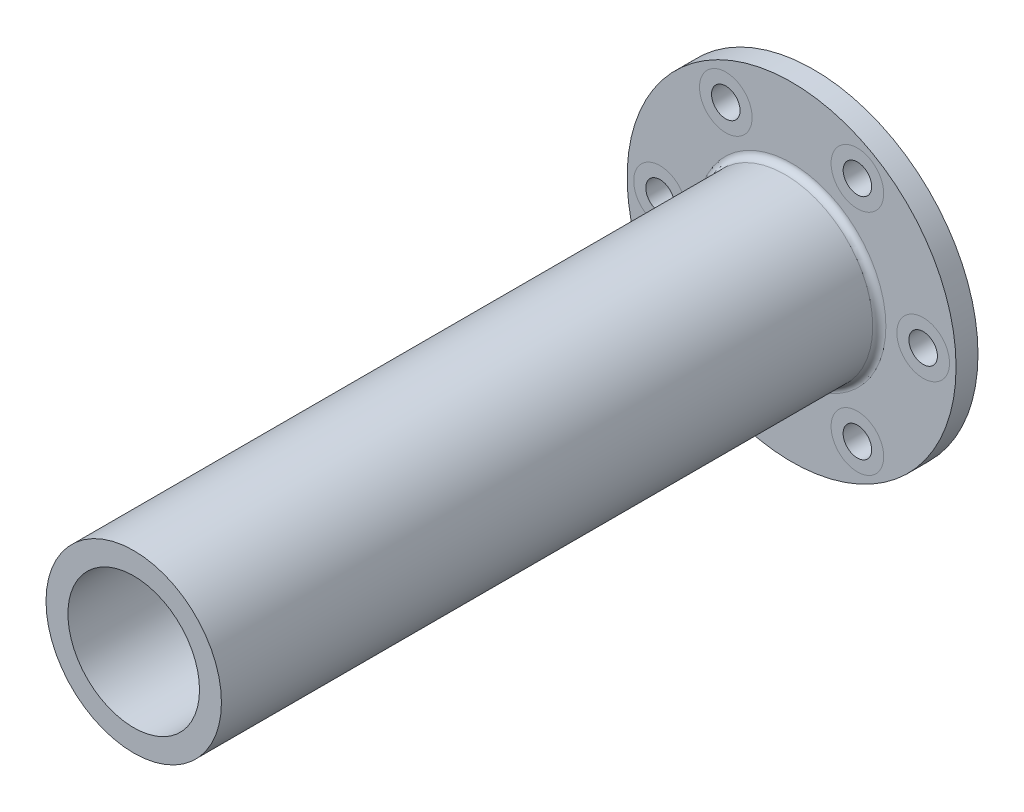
ISO-10303-21;
HEADER;
FILE_DESCRIPTION(('STEP AP214'),'2;1');
FILE_NAME('part.step','',(''),(''),'','','');
FILE_SCHEMA(('AUTOMOTIVE_DESIGN { 1 0 10303 214 1 1 1 1 }'));
ENDSEC;
DATA;
#1=APPLICATION_CONTEXT('core data for automotive mechanical design processes');
#2=APPLICATION_PROTOCOL_DEFINITION('international standard','automotive_design',2000,#1);
#3=PRODUCT_CONTEXT('',#1,'mechanical');
#4=PRODUCT('Part','Part','',(#3));
#5=PRODUCT_RELATED_PRODUCT_CATEGORY('part','',(#4));
#6=PRODUCT_DEFINITION_FORMATION('','',#4);
#7=PRODUCT_DEFINITION_CONTEXT('part definition',#1,'design');
#8=PRODUCT_DEFINITION('design','',#6,#7);
#9=PRODUCT_DEFINITION_SHAPE('','',#8);
#10=(LENGTH_UNIT() NAMED_UNIT(*) SI_UNIT(.MILLI.,.METRE.));
#11=(NAMED_UNIT(*) PLANE_ANGLE_UNIT() SI_UNIT($,.RADIAN.));
#12=(NAMED_UNIT(*) SI_UNIT($,.STERADIAN.) SOLID_ANGLE_UNIT());
#13=UNCERTAINTY_MEASURE_WITH_UNIT(LENGTH_MEASURE(1.E-05),#10,'distance_accuracy_value','');
#14=(GEOMETRIC_REPRESENTATION_CONTEXT(3) GLOBAL_UNCERTAINTY_ASSIGNED_CONTEXT((#13)) GLOBAL_UNIT_ASSIGNED_CONTEXT((#10,
#11,#12)) REPRESENTATION_CONTEXT('',''));
#15=CARTESIAN_POINT('',(0.,0.,0.));
#16=DIRECTION('',(0.,0.,1.));
#17=DIRECTION('',(1.,0.,0.));
#18=AXIS2_PLACEMENT_3D('',#15,#16,#17);
#19=CARTESIAN_POINT('',(0.,0.,10.));
#20=DIRECTION('',(0.,0.,1.));
#21=DIRECTION('',(1.,0.,0.));
#22=AXIS2_PLACEMENT_3D('',#19,#20,#21);
#23=PLANE('',#22);
#24=CARTESIAN_POINT('',(-29.9999999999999,51.9615242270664,10.));
#25=DIRECTION('',(0.,0.,1.));
#26=DIRECTION('',(1.,0.,0.));
#27=AXIS2_PLACEMENT_3D('',#24,#25,#26);
#28=CIRCLE('',#27,12.);
#29=CARTESIAN_POINT('',(-17.9999999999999,51.9615242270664,10.));
#30=VERTEX_POINT('',#29);
#31=EDGE_CURVE('E39',#30,#30,#28,.F.);
#32=ORIENTED_EDGE('',*,*,#31,.T.);
#33=EDGE_LOOP('',(#32));
#34=FACE_BOUND('',#33,.T.);
#35=CARTESIAN_POINT('',(60.,-4.18935719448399E-13,10.));
#36=DIRECTION('',(0.,0.,1.));
#37=DIRECTION('',(1.,0.,0.));
#38=AXIS2_PLACEMENT_3D('',#35,#36,#37);
#39=CIRCLE('',#38,12.);
#40=CARTESIAN_POINT('',(72.,-4.18935719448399E-13,10.));
#41=VERTEX_POINT('',#40);
#42=EDGE_CURVE('E53',#41,#41,#39,.F.);
#43=ORIENTED_EDGE('',*,*,#42,.T.);
#44=EDGE_LOOP('',(#43));
#45=FACE_BOUND('',#44,.T.);
#46=CARTESIAN_POINT('',(-30.0000000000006,-51.961524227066,10.));
#47=DIRECTION('',(0.,0.,1.));
#48=DIRECTION('',(1.,0.,0.));
#49=AXIS2_PLACEMENT_3D('',#46,#47,#48);
#50=CIRCLE('',#49,12.);
#51=CARTESIAN_POINT('',(-18.0000000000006,-51.961524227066,10.));
#52=VERTEX_POINT('',#51);
#53=EDGE_CURVE('E63',#52,#52,#50,.F.);
#54=ORIENTED_EDGE('',*,*,#53,.T.);
#55=EDGE_LOOP('',(#54));
#56=FACE_BOUND('',#55,.T.);
#57=CARTESIAN_POINT('',(0.,0.,10.));
#58=DIRECTION('',(0.,0.,1.));
#59=DIRECTION('',(1.,0.,0.));
#60=AXIS2_PLACEMENT_3D('',#57,#58,#59);
#61=CIRCLE('',#60,43.);
#62=CARTESIAN_POINT('',(43.,0.,10.));
#63=VERTEX_POINT('',#62);
#64=EDGE_CURVE('E67',#63,#63,#61,.F.);
#65=ORIENTED_EDGE('',*,*,#64,.T.);
#66=EDGE_LOOP('',(#65));
#67=FACE_BOUND('',#66,.T.);
#68=CARTESIAN_POINT('',(0.,0.,10.));
#69=DIRECTION('',(0.,0.,1.));
#70=DIRECTION('',(1.,0.,0.));
#71=AXIS2_PLACEMENT_3D('',#68,#69,#70);
#72=CIRCLE('',#71,75.);
#73=CARTESIAN_POINT('',(75.,0.,10.));
#74=VERTEX_POINT('',#73);
#75=EDGE_CURVE('E73',#74,#74,#72,.T.);
#76=ORIENTED_EDGE('',*,*,#75,.T.);
#77=EDGE_LOOP('',(#76));
#78=FACE_BOUND('',#77,.T.);
#79=CARTESIAN_POINT('',(29.9999999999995,-51.9615242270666,10.));
#80=DIRECTION('',(0.,0.,1.));
#81=DIRECTION('',(1.,0.,0.));
#82=AXIS2_PLACEMENT_3D('',#79,#80,#81);
#83=CIRCLE('',#82,12.);
#84=CARTESIAN_POINT('',(41.9999999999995,-51.9615242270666,10.));
#85=VERTEX_POINT('',#84);
#86=EDGE_CURVE('E59',#85,#85,#83,.F.);
#87=ORIENTED_EDGE('',*,*,#86,.T.);
#88=EDGE_LOOP('',(#87));
#89=FACE_BOUND('',#88,.T.);
#90=CARTESIAN_POINT('',(30.0000000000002,51.9615242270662,10.));
#91=DIRECTION('',(0.,0.,1.));
#92=DIRECTION('',(1.,0.,0.));
#93=AXIS2_PLACEMENT_3D('',#90,#91,#92);
#94=CIRCLE('',#93,12.);
#95=CARTESIAN_POINT('',(42.0000000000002,51.9615242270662,10.));
#96=VERTEX_POINT('',#95);
#97=EDGE_CURVE('E46',#96,#96,#94,.F.);
#98=ORIENTED_EDGE('',*,*,#97,.T.);
#99=EDGE_LOOP('',(#98));
#100=FACE_BOUND('',#99,.T.);
#101=CARTESIAN_POINT('',(-60.,0.,10.));
#102=DIRECTION('',(0.,0.,1.));
#103=DIRECTION('',(1.,0.,0.));
#104=AXIS2_PLACEMENT_3D('',#101,#102,#103);
#105=CIRCLE('',#104,12.);
#106=CARTESIAN_POINT('',(-48.,0.,10.));
#107=VERTEX_POINT('',#106);
#108=EDGE_CURVE('E10',#107,#107,#105,.F.);
#109=ORIENTED_EDGE('',*,*,#108,.T.);
#110=EDGE_LOOP('',(#109));
#111=FACE_BOUND('',#110,.T.);
#112=ADVANCED_FACE('F31',(#34,#45,#56,#67,#78,#89,#100,#111),#23,.T.);
#113=ORIENTED_EDGE('',*,*,#108,.F.);
#114=EDGE_LOOP('',(#113));
#115=FACE_BOUND('',#114,.T.);
#116=CARTESIAN_POINT('',(-60.,0.,10.));
#117=DIRECTION('',(0.,0.,1.));
#118=DIRECTION('',(1.,0.,0.));
#119=AXIS2_PLACEMENT_3D('',#116,#117,#118);
#120=CIRCLE('',#119,6.5);
#121=CARTESIAN_POINT('',(-53.5,0.,10.));
#122=VERTEX_POINT('',#121);
#123=EDGE_CURVE('E88',#122,#122,#120,.T.);
#124=ORIENTED_EDGE('',*,*,#123,.F.);
#125=EDGE_LOOP('',(#124));
#126=FACE_BOUND('',#125,.T.);
#127=ADVANCED_FACE('F157',(#115,#126),#23,.T.);
#128=ORIENTED_EDGE('',*,*,#31,.F.);
#129=EDGE_LOOP('',(#128));
#130=FACE_BOUND('',#129,.T.);
#131=CARTESIAN_POINT('',(-29.9999999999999,51.9615242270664,10.));
#132=DIRECTION('',(0.,0.,1.));
#133=DIRECTION('',(1.,0.,0.));
#134=AXIS2_PLACEMENT_3D('',#131,#132,#133);
#135=CIRCLE('',#134,6.5);
#136=CARTESIAN_POINT('',(-23.4999999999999,51.9615242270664,10.));
#137=VERTEX_POINT('',#136);
#138=EDGE_CURVE('E94',#137,#137,#135,.T.);
#139=ORIENTED_EDGE('',*,*,#138,.F.);
#140=EDGE_LOOP('',(#139));
#141=FACE_BOUND('',#140,.T.);
#142=ADVANCED_FACE('F162',(#130,#141),#23,.T.);
#143=ORIENTED_EDGE('',*,*,#97,.F.);
#144=EDGE_LOOP('',(#143));
#145=FACE_BOUND('',#144,.T.);
#146=CARTESIAN_POINT('',(30.0000000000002,51.9615242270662,10.));
#147=DIRECTION('',(0.,0.,1.));
#148=DIRECTION('',(1.,0.,0.));
#149=AXIS2_PLACEMENT_3D('',#146,#147,#148);
#150=CIRCLE('',#149,6.5);
#151=CARTESIAN_POINT('',(36.5000000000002,51.9615242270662,10.));
#152=VERTEX_POINT('',#151);
#153=EDGE_CURVE('E100',#152,#152,#150,.T.);
#154=ORIENTED_EDGE('',*,*,#153,.F.);
#155=EDGE_LOOP('',(#154));
#156=FACE_BOUND('',#155,.T.);
#157=ADVANCED_FACE('F228',(#145,#156),#23,.T.);
#158=ORIENTED_EDGE('',*,*,#42,.F.);
#159=EDGE_LOOP('',(#158));
#160=FACE_BOUND('',#159,.T.);
#161=CARTESIAN_POINT('',(60.,-4.18978003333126E-13,10.));
#162=DIRECTION('',(0.,0.,1.));
#163=DIRECTION('',(1.,0.,0.));
#164=AXIS2_PLACEMENT_3D('',#161,#162,#163);
#165=CIRCLE('',#164,6.5);
#166=CARTESIAN_POINT('',(66.5,-4.18978003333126E-13,10.));
#167=VERTEX_POINT('',#166);
#168=EDGE_CURVE('E106',#167,#167,#165,.T.);
#169=ORIENTED_EDGE('',*,*,#168,.F.);
#170=EDGE_LOOP('',(#169));
#171=FACE_BOUND('',#170,.T.);
#172=ADVANCED_FACE('F220',(#160,#171),#23,.T.);
#173=ORIENTED_EDGE('',*,*,#86,.F.);
#174=EDGE_LOOP('',(#173));
#175=FACE_BOUND('',#174,.T.);
#176=CARTESIAN_POINT('',(29.9999999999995,-51.9615242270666,10.));
#177=DIRECTION('',(0.,0.,1.));
#178=DIRECTION('',(1.,0.,0.));
#179=AXIS2_PLACEMENT_3D('',#176,#177,#178);
#180=CIRCLE('',#179,6.5);
#181=CARTESIAN_POINT('',(36.4999999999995,-51.9615242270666,10.));
#182=VERTEX_POINT('',#181);
#183=EDGE_CURVE('E112',#182,#182,#180,.T.);
#184=ORIENTED_EDGE('',*,*,#183,.F.);
#185=EDGE_LOOP('',(#184));
#186=FACE_BOUND('',#185,.T.);
#187=ADVANCED_FACE('F153',(#175,#186),#23,.T.);
#188=ORIENTED_EDGE('',*,*,#53,.F.);
#189=EDGE_LOOP('',(#188));
#190=FACE_BOUND('',#189,.T.);
#191=CARTESIAN_POINT('',(-30.0000000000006,-51.961524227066,10.));
#192=DIRECTION('',(0.,0.,1.));
#193=DIRECTION('',(1.,0.,0.));
#194=AXIS2_PLACEMENT_3D('',#191,#192,#193);
#195=CIRCLE('',#194,6.5);
#196=CARTESIAN_POINT('',(-23.5000000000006,-51.961524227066,10.));
#197=VERTEX_POINT('',#196);
#198=EDGE_CURVE('E118',#197,#197,#195,.T.);
#199=ORIENTED_EDGE('',*,*,#198,.F.);
#200=EDGE_LOOP('',(#199));
#201=FACE_BOUND('',#200,.T.);
#202=ADVANCED_FACE('F147',(#190,#201),#23,.T.);
#203=CARTESIAN_POINT('',(0.,0.,10.));
#204=DIRECTION('',(0.,0.,-1.));
#205=DIRECTION('',(-1.,0.,0.));
#206=AXIS2_PLACEMENT_3D('',#203,#204,#205);
#207=CYLINDRICAL_SURFACE('',#206,75.);
#208=ORIENTED_EDGE('',*,*,#75,.F.);
#209=EDGE_LOOP('',(#208));
#210=FACE_BOUND('',#209,.T.);
#211=CARTESIAN_POINT('',(0.,0.,0.));
#212=DIRECTION('',(0.,0.,1.));
#213=DIRECTION('',(1.,0.,0.));
#214=AXIS2_PLACEMENT_3D('',#211,#212,#213);
#215=CIRCLE('',#214,75.);
#216=CARTESIAN_POINT('',(75.,0.,0.));
#217=VERTEX_POINT('',#216);
#218=EDGE_CURVE('E76',#217,#217,#215,.T.);
#219=ORIENTED_EDGE('',*,*,#218,.T.);
#220=EDGE_LOOP('',(#219));
#221=FACE_BOUND('',#220,.T.);
#222=ADVANCED_FACE('F33',(#210,#221),#207,.T.);
#223=CARTESIAN_POINT('',(0.,0.,0.));
#224=DIRECTION('',(0.,0.,1.));
#225=DIRECTION('',(1.,0.,0.));
#226=AXIS2_PLACEMENT_3D('',#223,#224,#225);
#227=PLANE('',#226);
#228=CARTESIAN_POINT('',(-30.0000000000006,-51.961524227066,0.));
#229=DIRECTION('',(0.,0.,-1.));
#230=DIRECTION('',(-0.50000000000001,-0.866025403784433,0.));
#231=AXIS2_PLACEMENT_3D('',#228,#229,#230);
#232=CIRCLE('',#231,6.5);
#233=CARTESIAN_POINT('',(-33.2500000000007,-57.5906893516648,0.));
#234=VERTEX_POINT('',#233);
#235=EDGE_CURVE('E121',#234,#234,#232,.T.);
#236=ORIENTED_EDGE('',*,*,#235,.F.);
#237=EDGE_LOOP('',(#236));
#238=FACE_BOUND('',#237,.T.);
#239=CARTESIAN_POINT('',(29.9999999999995,-51.9615242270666,0.));
#240=DIRECTION('',(0.,0.,-1.));
#241=DIRECTION('',(0.499999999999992,-0.866025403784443,0.));
#242=AXIS2_PLACEMENT_3D('',#239,#240,#241);
#243=CIRCLE('',#242,6.5);
#244=CARTESIAN_POINT('',(33.2499999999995,-57.5906893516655,0.));
#245=VERTEX_POINT('',#244);
#246=EDGE_CURVE('E115',#245,#245,#243,.T.);
#247=ORIENTED_EDGE('',*,*,#246,.F.);
#248=EDGE_LOOP('',(#247));
#249=FACE_BOUND('',#248,.T.);
#250=CARTESIAN_POINT('',(60.,-4.18978003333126E-13,0.));
#251=DIRECTION('',(0.,0.,-1.));
#252=DIRECTION('',(1.,0.,0.));
#253=AXIS2_PLACEMENT_3D('',#250,#251,#252);
#254=CIRCLE('',#253,6.5);
#255=CARTESIAN_POINT('',(66.5,-4.64367287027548E-13,0.));
#256=VERTEX_POINT('',#255);
#257=EDGE_CURVE('E109',#256,#256,#254,.T.);
#258=ORIENTED_EDGE('',*,*,#257,.F.);
#259=EDGE_LOOP('',(#258));
#260=FACE_BOUND('',#259,.T.);
#261=CARTESIAN_POINT('',(30.0000000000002,51.9615242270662,0.));
#262=DIRECTION('',(0.,0.,-1.));
#263=DIRECTION('',(0.500000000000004,0.866025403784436,0.));
#264=AXIS2_PLACEMENT_3D('',#261,#262,#263);
#265=CIRCLE('',#264,6.5);
#266=CARTESIAN_POINT('',(33.2500000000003,57.590689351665,0.));
#267=VERTEX_POINT('',#266);
#268=EDGE_CURVE('E103',#267,#267,#265,.T.);
#269=ORIENTED_EDGE('',*,*,#268,.F.);
#270=EDGE_LOOP('',(#269));
#271=FACE_BOUND('',#270,.T.);
#272=CARTESIAN_POINT('',(-29.9999999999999,51.9615242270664,0.));
#273=DIRECTION('',(0.,0.,-1.));
#274=DIRECTION('',(-0.499999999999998,0.86602540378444,0.));
#275=AXIS2_PLACEMENT_3D('',#272,#273,#274);
#276=CIRCLE('',#275,6.5);
#277=CARTESIAN_POINT('',(-33.2499999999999,57.5906893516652,0.));
#278=VERTEX_POINT('',#277);
#279=EDGE_CURVE('E97',#278,#278,#276,.T.);
#280=ORIENTED_EDGE('',*,*,#279,.F.);
#281=EDGE_LOOP('',(#280));
#282=FACE_BOUND('',#281,.T.);
#283=CARTESIAN_POINT('',(-60.,0.,0.));
#284=DIRECTION('',(0.,0.,-1.));
#285=DIRECTION('',(-1.,0.,0.));
#286=AXIS2_PLACEMENT_3D('',#283,#284,#285);
#287=CIRCLE('',#286,6.5);
#288=CARTESIAN_POINT('',(-66.5,0.,0.));
#289=VERTEX_POINT('',#288);
#290=EDGE_CURVE('E91',#289,#289,#287,.T.);
#291=ORIENTED_EDGE('',*,*,#290,.F.);
#292=EDGE_LOOP('',(#291));
#293=FACE_BOUND('',#292,.T.);
#294=CARTESIAN_POINT('',(0.,0.,0.));
#295=DIRECTION('',(0.,0.,1.));
#296=DIRECTION('',(1.,0.,0.));
#297=AXIS2_PLACEMENT_3D('',#294,#295,#296);
#298=CIRCLE('',#297,30.);
#299=CARTESIAN_POINT('',(30.,0.,0.));
#300=VERTEX_POINT('',#299);
#301=EDGE_CURVE('E82',#300,#300,#298,.T.);
#302=ORIENTED_EDGE('',*,*,#301,.T.);
#303=EDGE_LOOP('',(#302));
#304=FACE_BOUND('',#303,.T.);
#305=ORIENTED_EDGE('',*,*,#218,.F.);
#306=EDGE_LOOP('',(#305));
#307=FACE_BOUND('',#306,.T.);
#308=ADVANCED_FACE('F127',(#238,#249,#260,#271,#282,#293,#304,#307),#227,.F.);
#309=CARTESIAN_POINT('',(0.,0.,310.));
#310=DIRECTION('',(0.,0.,-1.));
#311=DIRECTION('',(-1.,0.,0.));
#312=AXIS2_PLACEMENT_3D('',#309,#310,#311);
#313=CYLINDRICAL_SURFACE('',#312,40.);
#314=CARTESIAN_POINT('',(0.,0.,13.));
#315=DIRECTION('',(0.,0.,1.));
#316=DIRECTION('',(1.,0.,0.));
#317=AXIS2_PLACEMENT_3D('',#314,#315,#316);
#318=CIRCLE('',#317,40.);
#319=CARTESIAN_POINT('',(40.,0.,13.));
#320=VERTEX_POINT('',#319);
#321=EDGE_CURVE('E70',#320,#320,#318,.T.);
#322=ORIENTED_EDGE('',*,*,#321,.T.);
#323=EDGE_LOOP('',(#322));
#324=FACE_BOUND('',#323,.T.);
#325=CARTESIAN_POINT('',(0.,0.,310.));
#326=DIRECTION('',(0.,0.,1.));
#327=DIRECTION('',(1.,0.,0.));
#328=AXIS2_PLACEMENT_3D('',#325,#326,#327);
#329=CIRCLE('',#328,40.);
#330=CARTESIAN_POINT('',(40.,0.,310.));
#331=VERTEX_POINT('',#330);
#332=EDGE_CURVE('E79',#331,#331,#329,.T.);
#333=ORIENTED_EDGE('',*,*,#332,.F.);
#334=EDGE_LOOP('',(#333));
#335=FACE_BOUND('',#334,.T.);
#336=ADVANCED_FACE('F130',(#324,#335),#313,.T.);
#337=CARTESIAN_POINT('',(0.,0.,310.));
#338=DIRECTION('',(0.,0.,1.));
#339=DIRECTION('',(1.,0.,0.));
#340=AXIS2_PLACEMENT_3D('',#337,#338,#339);
#341=PLANE('',#340);
#342=CARTESIAN_POINT('',(0.,0.,310.));
#343=DIRECTION('',(0.,0.,1.));
#344=DIRECTION('',(1.,0.,0.));
#345=AXIS2_PLACEMENT_3D('',#342,#343,#344);
#346=CIRCLE('',#345,30.);
#347=CARTESIAN_POINT('',(30.,0.,310.));
#348=VERTEX_POINT('',#347);
#349=EDGE_CURVE('E85',#348,#348,#346,.T.);
#350=ORIENTED_EDGE('',*,*,#349,.F.);
#351=EDGE_LOOP('',(#350));
#352=FACE_BOUND('',#351,.T.);
#353=ORIENTED_EDGE('',*,*,#332,.T.);
#354=EDGE_LOOP('',(#353));
#355=FACE_BOUND('',#354,.T.);
#356=ADVANCED_FACE('F168',(#352,#355),#341,.T.);
#357=CARTESIAN_POINT('',(0.,0.,0.));
#358=DIRECTION('',(0.,0.,1.));
#359=DIRECTION('',(1.,0.,0.));
#360=AXIS2_PLACEMENT_3D('',#357,#358,#359);
#361=CYLINDRICAL_SURFACE('',#360,30.);
#362=ORIENTED_EDGE('',*,*,#301,.F.);
#363=EDGE_LOOP('',(#362));
#364=FACE_BOUND('',#363,.T.);
#365=ORIENTED_EDGE('',*,*,#349,.T.);
#366=EDGE_LOOP('',(#365));
#367=FACE_BOUND('',#366,.T.);
#368=ADVANCED_FACE('F171',(#364,#367),#361,.F.);
#369=CARTESIAN_POINT('',(0.,0.,13.));
#370=DIRECTION('',(0.,0.,1.));
#371=DIRECTION('',(1.,0.,0.));
#372=AXIS2_PLACEMENT_3D('',#369,#370,#371);
#373=TOROIDAL_SURFACE('',#372,43.,3.);
#374=ORIENTED_EDGE('',*,*,#64,.F.);
#375=EDGE_LOOP('',(#374));
#376=FACE_BOUND('',#375,.T.);
#377=ORIENTED_EDGE('',*,*,#321,.F.);
#378=EDGE_LOOP('',(#377));
#379=FACE_BOUND('',#378,.T.);
#380=ADVANCED_FACE('F175',(#376,#379),#373,.F.);
#381=CARTESIAN_POINT('',(-60.,0.,310.));
#382=DIRECTION('',(0.,0.,-1.));
#383=DIRECTION('',(-1.,0.,0.));
#384=AXIS2_PLACEMENT_3D('',#381,#382,#383);
#385=CYLINDRICAL_SURFACE('',#384,6.5);
#386=ORIENTED_EDGE('',*,*,#123,.T.);
#387=EDGE_LOOP('',(#386));
#388=FACE_BOUND('',#387,.T.);
#389=ORIENTED_EDGE('',*,*,#290,.T.);
#390=EDGE_LOOP('',(#389));
#391=FACE_BOUND('',#390,.T.);
#392=ADVANCED_FACE('F179',(#388,#391),#385,.F.);
#393=CARTESIAN_POINT('',(-29.9999999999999,51.9615242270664,310.));
#394=DIRECTION('',(0.,0.,-1.));
#395=DIRECTION('',(-1.,0.,0.));
#396=AXIS2_PLACEMENT_3D('',#393,#394,#395);
#397=CYLINDRICAL_SURFACE('',#396,6.5);
#398=ORIENTED_EDGE('',*,*,#138,.T.);
#399=EDGE_LOOP('',(#398));
#400=FACE_BOUND('',#399,.T.);
#401=ORIENTED_EDGE('',*,*,#279,.T.);
#402=EDGE_LOOP('',(#401));
#403=FACE_BOUND('',#402,.T.);
#404=ADVANCED_FACE('F183',(#400,#403),#397,.F.);
#405=CARTESIAN_POINT('',(30.0000000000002,51.9615242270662,310.));
#406=DIRECTION('',(0.,0.,-1.));
#407=DIRECTION('',(-1.,0.,0.));
#408=AXIS2_PLACEMENT_3D('',#405,#406,#407);
#409=CYLINDRICAL_SURFACE('',#408,6.5);
#410=ORIENTED_EDGE('',*,*,#153,.T.);
#411=EDGE_LOOP('',(#410));
#412=FACE_BOUND('',#411,.T.);
#413=ORIENTED_EDGE('',*,*,#268,.T.);
#414=EDGE_LOOP('',(#413));
#415=FACE_BOUND('',#414,.T.);
#416=ADVANCED_FACE('F187',(#412,#415),#409,.F.);
#417=CARTESIAN_POINT('',(60.,-4.18978003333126E-13,310.));
#418=DIRECTION('',(0.,0.,-1.));
#419=DIRECTION('',(-1.,0.,0.));
#420=AXIS2_PLACEMENT_3D('',#417,#418,#419);
#421=CYLINDRICAL_SURFACE('',#420,6.5);
#422=ORIENTED_EDGE('',*,*,#168,.T.);
#423=EDGE_LOOP('',(#422));
#424=FACE_BOUND('',#423,.T.);
#425=ORIENTED_EDGE('',*,*,#257,.T.);
#426=EDGE_LOOP('',(#425));
#427=FACE_BOUND('',#426,.T.);
#428=ADVANCED_FACE('F191',(#424,#427),#421,.F.);
#429=CARTESIAN_POINT('',(29.9999999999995,-51.9615242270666,310.));
#430=DIRECTION('',(0.,0.,-1.));
#431=DIRECTION('',(-1.,0.,0.));
#432=AXIS2_PLACEMENT_3D('',#429,#430,#431);
#433=CYLINDRICAL_SURFACE('',#432,6.5);
#434=ORIENTED_EDGE('',*,*,#183,.T.);
#435=EDGE_LOOP('',(#434));
#436=FACE_BOUND('',#435,.T.);
#437=ORIENTED_EDGE('',*,*,#246,.T.);
#438=EDGE_LOOP('',(#437));
#439=FACE_BOUND('',#438,.T.);
#440=ADVANCED_FACE('F195',(#436,#439),#433,.F.);
#441=CARTESIAN_POINT('',(-30.0000000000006,-51.961524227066,310.));
#442=DIRECTION('',(0.,0.,-1.));
#443=DIRECTION('',(-1.,0.,0.));
#444=AXIS2_PLACEMENT_3D('',#441,#442,#443);
#445=CYLINDRICAL_SURFACE('',#444,6.5);
#446=ORIENTED_EDGE('',*,*,#198,.T.);
#447=EDGE_LOOP('',(#446));
#448=FACE_BOUND('',#447,.T.);
#449=ORIENTED_EDGE('',*,*,#235,.T.);
#450=EDGE_LOOP('',(#449));
#451=FACE_BOUND('',#450,.T.);
#452=ADVANCED_FACE('F125',(#448,#451),#445,.F.);
#453=CLOSED_SHELL('',(#112,#127,#142,#157,#172,#187,#202,#222,#308,#336,#356,#368,#380,#392,
#404,#416,#428,#440,#452));
#454=MANIFOLD_SOLID_BREP('B2',#453);
#455=ADVANCED_BREP_SHAPE_REPRESENTATION('',(#18,#454),#14);
#456=SHAPE_DEFINITION_REPRESENTATION(#9,#455);
ENDSEC;
END-ISO-10303-21;
